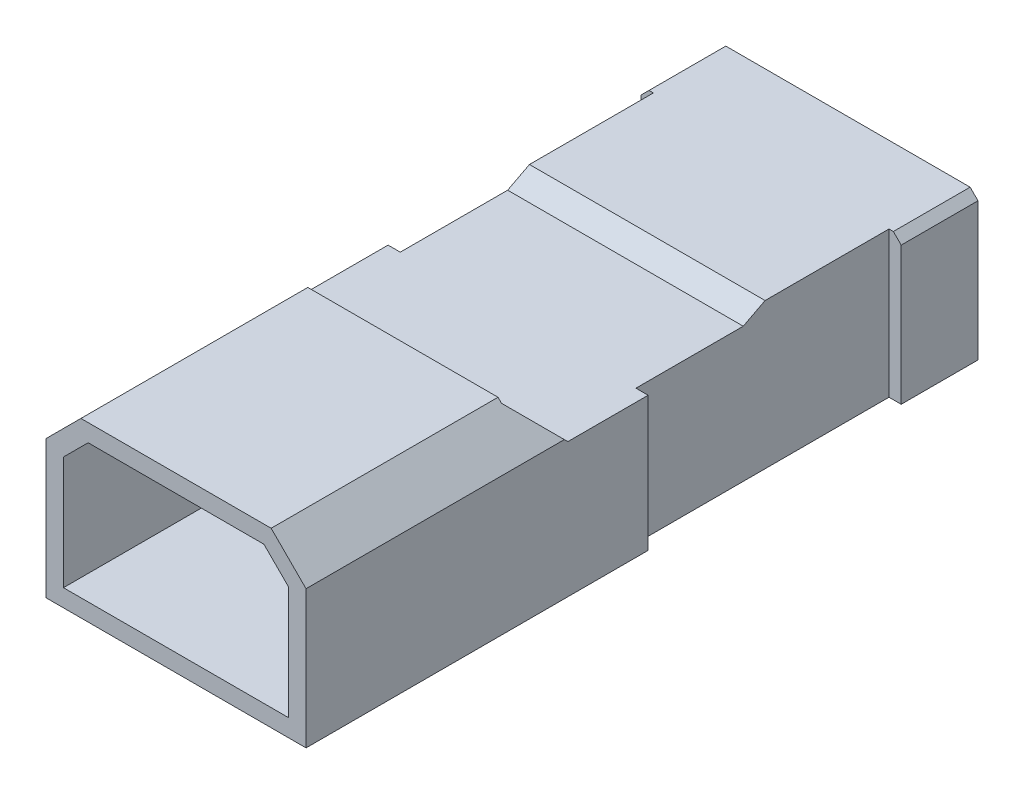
ISO-10303-21;
HEADER;
FILE_DESCRIPTION(('STEP AP214'),'2;1');
FILE_NAME('part.step','',(''),(''),'','','');
FILE_SCHEMA(('AUTOMOTIVE_DESIGN { 1 0 10303 214 1 1 1 1 }'));
ENDSEC;
DATA;
#1=APPLICATION_CONTEXT('core data for automotive mechanical design processes');
#2=APPLICATION_PROTOCOL_DEFINITION('international standard','automotive_design',2000,#1);
#3=PRODUCT_CONTEXT('',#1,'mechanical');
#4=PRODUCT('Part','Part','',(#3));
#5=PRODUCT_RELATED_PRODUCT_CATEGORY('part','',(#4));
#6=PRODUCT_DEFINITION_FORMATION('','',#4);
#7=PRODUCT_DEFINITION_CONTEXT('part definition',#1,'design');
#8=PRODUCT_DEFINITION('design','',#6,#7);
#9=PRODUCT_DEFINITION_SHAPE('','',#8);
#10=(LENGTH_UNIT() NAMED_UNIT(*) SI_UNIT(.MILLI.,.METRE.));
#11=(NAMED_UNIT(*) PLANE_ANGLE_UNIT() SI_UNIT($,.RADIAN.));
#12=(NAMED_UNIT(*) SI_UNIT($,.STERADIAN.) SOLID_ANGLE_UNIT());
#13=UNCERTAINTY_MEASURE_WITH_UNIT(LENGTH_MEASURE(1.E-05),#10,'distance_accuracy_value','');
#14=(GEOMETRIC_REPRESENTATION_CONTEXT(3) GLOBAL_UNCERTAINTY_ASSIGNED_CONTEXT((#13)) GLOBAL_UNIT_ASSIGNED_CONTEXT((#10,
#11,#12)) REPRESENTATION_CONTEXT('',''));
#15=CARTESIAN_POINT('',(0.,0.,0.));
#16=DIRECTION('',(0.,0.,1.));
#17=DIRECTION('',(1.,0.,0.));
#18=AXIS2_PLACEMENT_3D('',#15,#16,#17);
#19=CARTESIAN_POINT('',(-17.7816005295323,1.9558,12.954));
#20=DIRECTION('',(0.,0.,1.));
#21=DIRECTION('',(1.,0.,0.));
#22=AXIS2_PLACEMENT_3D('',#19,#20,#21);
#23=PLANE('',#22);
#24=DIRECTION('',(-0.707106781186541,-0.707106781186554,0.));
#25=VECTOR('',#24,1.);
#26=CARTESIAN_POINT('',(-2.76859999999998,2.5146,12.954));
#27=LINE('',#26,#25);
#28=CARTESIAN_POINT('',(-2.76859999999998,2.51459999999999,12.954));
#29=VERTEX_POINT('',#28);
#30=CARTESIAN_POINT('',(-2.87019999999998,2.413,12.954));
#31=VERTEX_POINT('',#30);
#32=EDGE_CURVE('E20',#29,#31,#27,.T.);
#33=ORIENTED_EDGE('',*,*,#32,.F.);
#34=DIRECTION('',(-1.,0.,0.));
#35=VECTOR('',#34,1.);
#36=CARTESIAN_POINT('',(0.,2.51459999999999,12.954));
#37=LINE('',#36,#35);
#38=CARTESIAN_POINT('',(2.7686,2.5146,12.954));
#39=VERTEX_POINT('',#38);
#40=EDGE_CURVE('E385',#39,#29,#37,.T.);
#41=ORIENTED_EDGE('',*,*,#40,.F.);
#42=DIRECTION('',(-0.707106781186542,0.707106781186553,0.));
#43=VECTOR('',#42,1.);
#44=CARTESIAN_POINT('',(3.2766,2.00659999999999,12.954));
#45=LINE('',#44,#43);
#46=CARTESIAN_POINT('',(2.8702,2.413,12.954));
#47=VERTEX_POINT('',#46);
#48=EDGE_CURVE('E345',#47,#39,#45,.T.);
#49=ORIENTED_EDGE('',*,*,#48,.F.);
#50=DIRECTION('',(1.,0.,0.));
#51=VECTOR('',#50,1.);
#52=CARTESIAN_POINT('',(-17.7816005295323,2.413,12.954));
#53=LINE('',#52,#51);
#54=EDGE_CURVE('E303',#31,#47,#53,.T.);
#55=ORIENTED_EDGE('',*,*,#54,.F.);
#56=EDGE_LOOP('',(#33,#41,#49,#55));
#57=FACE_BOUND('',#56,.T.);
#58=ADVANCED_FACE('F17',(#57),#23,.F.);
#59=CARTESIAN_POINT('',(-3.60679999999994,-19.0516005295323,10.1092));
#60=DIRECTION('',(0.,0.,1.));
#61=DIRECTION('',(1.,0.,0.));
#62=AXIS2_PLACEMENT_3D('',#59,#60,#61);
#63=PLANE('',#62);
#64=DIRECTION('',(1.,0.,0.));
#65=VECTOR('',#64,1.);
#66=CARTESIAN_POINT('',(-3.60679999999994,-2.0066,10.1092));
#67=LINE('',#66,#65);
#68=CARTESIAN_POINT('',(-3.2766,-2.0066,10.1092));
#69=VERTEX_POINT('',#68);
#70=CARTESIAN_POINT('',(-2.92099999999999,-2.0066,10.1092));
#71=VERTEX_POINT('',#70);
#72=EDGE_CURVE('E326',#69,#71,#67,.T.);
#73=ORIENTED_EDGE('',*,*,#72,.T.);
#74=DIRECTION('',(0.,1.,0.));
#75=VECTOR('',#74,1.);
#76=CARTESIAN_POINT('',(-2.92099999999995,-19.0516005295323,10.1092));
#77=LINE('',#76,#75);
#78=CARTESIAN_POINT('',(-2.921,0.888999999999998,10.1092));
#79=VERTEX_POINT('',#78);
#80=EDGE_CURVE('E399',#79,#71,#77,.F.);
#81=ORIENTED_EDGE('',*,*,#80,.F.);
#82=DIRECTION('',(1.,0.,0.));
#83=VECTOR('',#82,1.);
#84=CARTESIAN_POINT('',(-17.7816005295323,0.888999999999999,10.1092));
#85=LINE('',#84,#83);
#86=CARTESIAN_POINT('',(-3.2766,0.888999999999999,10.1092));
#87=VERTEX_POINT('',#86);
#88=EDGE_CURVE('E310',#87,#79,#85,.T.);
#89=ORIENTED_EDGE('',*,*,#88,.F.);
#90=DIRECTION('',(0.,1.,0.));
#91=VECTOR('',#90,1.);
#92=CARTESIAN_POINT('',(-3.2766,-0.508,10.1092));
#93=LINE('',#92,#91);
#94=EDGE_CURVE('E375',#87,#69,#93,.F.);
#95=ORIENTED_EDGE('',*,*,#94,.T.);
#96=EDGE_LOOP('',(#73,#81,#89,#95));
#97=FACE_BOUND('',#96,.T.);
#98=ADVANCED_FACE('F1001',(#97),#63,.T.);
#99=CARTESIAN_POINT('',(-17.7816005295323,1.54578975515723,12.8052102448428));
#100=DIRECTION('',(0.,0.707106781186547,-0.707106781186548));
#101=DIRECTION('',(0.,0.707106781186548,0.707106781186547));
#102=AXIS2_PLACEMENT_3D('',#99,#100,#101);
#103=PLANE('',#102);
#104=DIRECTION('',(-1.,0.,0.));
#105=VECTOR('',#104,1.);
#106=CARTESIAN_POINT('',(0.,2.00659999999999,13.2660204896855));
#107=LINE('',#106,#105);
#108=CARTESIAN_POINT('',(2.55817951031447,2.00659999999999,13.2660204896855));
#109=VERTEX_POINT('',#108);
#110=CARTESIAN_POINT('',(-2.55817951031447,2.00659999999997,13.2660204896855));
#111=VERTEX_POINT('',#110);
#112=EDGE_CURVE('E367',#109,#111,#107,.T.);
#113=ORIENTED_EDGE('',*,*,#112,.T.);
#114=DIRECTION('',(-0.577350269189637,-0.577350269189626,-0.577350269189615));
#115=VECTOR('',#114,1.);
#116=CARTESIAN_POINT('',(-2.55817951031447,2.00659999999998,13.2660204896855));
#117=LINE('',#116,#115);
#118=CARTESIAN_POINT('',(-3.2766,1.28817951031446,12.5476));
#119=VERTEX_POINT('',#118);
#120=EDGE_CURVE('E321',#111,#119,#117,.T.);
#121=ORIENTED_EDGE('',*,*,#120,.T.);
#122=DIRECTION('',(0.,-0.707106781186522,-0.707106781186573));
#123=VECTOR('',#122,1.);
#124=CARTESIAN_POINT('',(-3.2766,1.28817951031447,12.5476));
#125=LINE('',#124,#123);
#126=CARTESIAN_POINT('',(-3.2766,0.888999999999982,12.1484204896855));
#127=VERTEX_POINT('',#126);
#128=EDGE_CURVE('E380',#119,#127,#125,.T.);
#129=ORIENTED_EDGE('',*,*,#128,.T.);
#130=DIRECTION('',(1.,0.,0.));
#131=VECTOR('',#130,1.);
#132=CARTESIAN_POINT('',(-17.7816005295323,0.888999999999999,12.1484204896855));
#133=LINE('',#132,#131);
#134=CARTESIAN_POINT('',(3.2766,0.888999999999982,12.1484204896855));
#135=VERTEX_POINT('',#134);
#136=EDGE_CURVE('E312',#135,#127,#133,.F.);
#137=ORIENTED_EDGE('',*,*,#136,.F.);
#138=DIRECTION('',(0.,0.707106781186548,0.707106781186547));
#139=VECTOR('',#138,1.);
#140=CARTESIAN_POINT('',(3.2766,1.54578975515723,12.8052102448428));
#141=LINE('',#140,#139);
#142=CARTESIAN_POINT('',(3.2766,1.28817951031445,12.5476));
#143=VERTEX_POINT('',#142);
#144=EDGE_CURVE('E325',#143,#135,#141,.F.);
#145=ORIENTED_EDGE('',*,*,#144,.F.);
#146=DIRECTION('',(-0.577350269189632,0.577350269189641,0.577350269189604));
#147=VECTOR('',#146,1.);
#148=CARTESIAN_POINT('',(3.2766,1.28817951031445,12.5476));
#149=LINE('',#148,#147);
#150=EDGE_CURVE('E317',#143,#109,#149,.T.);
#151=ORIENTED_EDGE('',*,*,#150,.T.);
#152=EDGE_LOOP('',(#113,#121,#129,#137,#145,#151));
#153=FACE_BOUND('',#152,.T.);
#154=ADVANCED_FACE('F628',(#153),#103,.F.);
#155=CARTESIAN_POINT('',(-2.91738975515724,1.64738975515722,0.));
#156=DIRECTION('',(-0.707106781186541,0.707106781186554,0.));
#157=DIRECTION('',(-0.707106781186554,-0.707106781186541,0.));
#158=AXIS2_PLACEMENT_3D('',#155,#156,#157);
#159=PLANE('',#158);
#160=DIRECTION('',(0.,0.,1.));
#161=VECTOR('',#160,1.);
#162=CARTESIAN_POINT('',(-2.55817951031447,2.00659999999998,0.));
#163=LINE('',#162,#161);
#164=CARTESIAN_POINT('',(-2.55817951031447,2.00659999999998,19.558));
#165=VERTEX_POINT('',#164);
#166=EDGE_CURVE('E364',#111,#165,#163,.T.);
#167=ORIENTED_EDGE('',*,*,#166,.T.);
#168=DIRECTION('',(-0.707106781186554,-0.707106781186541,0.));
#169=VECTOR('',#168,1.);
#170=CARTESIAN_POINT('',(-2.91738975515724,1.64738975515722,19.558));
#171=LINE('',#170,#169);
#172=CARTESIAN_POINT('',(-3.2766,1.28817951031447,19.558));
#173=VERTEX_POINT('',#172);
#174=EDGE_CURVE('E323',#173,#165,#171,.F.);
#175=ORIENTED_EDGE('',*,*,#174,.F.);
#176=DIRECTION('',(0.,0.,1.));
#177=VECTOR('',#176,1.);
#178=CARTESIAN_POINT('',(-3.2766,1.28817951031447,0.));
#179=LINE('',#178,#177);
#180=EDGE_CURVE('E372',#173,#119,#179,.F.);
#181=ORIENTED_EDGE('',*,*,#180,.T.);
#182=ORIENTED_EDGE('',*,*,#120,.F.);
#183=EDGE_LOOP('',(#167,#175,#181,#182));
#184=FACE_BOUND('',#183,.T.);
#185=ADVANCED_FACE('F633',(#184),#159,.F.);
#186=CARTESIAN_POINT('',(2.91738975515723,1.64738975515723,0.));
#187=DIRECTION('',(0.707106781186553,0.707106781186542,0.));
#188=DIRECTION('',(-0.707106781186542,0.707106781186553,0.));
#189=AXIS2_PLACEMENT_3D('',#186,#187,#188);
#190=PLANE('',#189);
#191=ORIENTED_EDGE('',*,*,#150,.F.);
#192=DIRECTION('',(0.,0.,-1.));
#193=VECTOR('',#192,1.);
#194=CARTESIAN_POINT('',(3.2766,1.28817951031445,0.));
#195=LINE('',#194,#193);
#196=CARTESIAN_POINT('',(3.2766,1.28817951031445,19.558));
#197=VERTEX_POINT('',#196);
#198=EDGE_CURVE('E361',#143,#197,#195,.F.);
#199=ORIENTED_EDGE('',*,*,#198,.T.);
#200=DIRECTION('',(-0.707106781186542,0.707106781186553,0.));
#201=VECTOR('',#200,1.);
#202=CARTESIAN_POINT('',(2.91738975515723,1.64738975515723,19.558));
#203=LINE('',#202,#201);
#204=CARTESIAN_POINT('',(2.55817951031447,2.00659999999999,19.558));
#205=VERTEX_POINT('',#204);
#206=EDGE_CURVE('E319',#205,#197,#203,.F.);
#207=ORIENTED_EDGE('',*,*,#206,.F.);
#208=DIRECTION('',(0.,0.,1.));
#209=VECTOR('',#208,1.);
#210=CARTESIAN_POINT('',(2.55817951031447,2.0066,0.));
#211=LINE('',#210,#209);
#212=EDGE_CURVE('E369',#205,#109,#211,.F.);
#213=ORIENTED_EDGE('',*,*,#212,.T.);
#214=EDGE_LOOP('',(#191,#199,#207,#213));
#215=FACE_BOUND('',#214,.T.);
#216=ADVANCED_FACE('F640',(#215),#190,.F.);
#217=CARTESIAN_POINT('',(3.60680000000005,-19.0516005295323,10.1092));
#218=DIRECTION('',(0.,0.,1.));
#219=DIRECTION('',(1.,0.,0.));
#220=AXIS2_PLACEMENT_3D('',#217,#218,#219);
#221=PLANE('',#220);
#222=DIRECTION('',(1.,0.,0.));
#223=VECTOR('',#222,1.);
#224=CARTESIAN_POINT('',(3.60680000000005,-2.0066,10.1092));
#225=LINE('',#224,#223);
#226=CARTESIAN_POINT('',(2.921,-2.0066,10.1092));
#227=VERTEX_POINT('',#226);
#228=CARTESIAN_POINT('',(3.2766,-2.0066,10.1092));
#229=VERTEX_POINT('',#228);
#230=EDGE_CURVE('E315',#227,#229,#225,.T.);
#231=ORIENTED_EDGE('',*,*,#230,.T.);
#232=DIRECTION('',(0.,1.,0.));
#233=VECTOR('',#232,1.);
#234=CARTESIAN_POINT('',(3.2766,-0.508000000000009,10.1092));
#235=LINE('',#234,#233);
#236=CARTESIAN_POINT('',(3.2766,0.888999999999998,10.1092));
#237=VERTEX_POINT('',#236);
#238=EDGE_CURVE('E356',#229,#237,#235,.T.);
#239=ORIENTED_EDGE('',*,*,#238,.T.);
#240=DIRECTION('',(1.,0.,0.));
#241=VECTOR('',#240,1.);
#242=CARTESIAN_POINT('',(-17.7816005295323,0.888999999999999,10.1092));
#243=LINE('',#242,#241);
#244=CARTESIAN_POINT('',(2.921,0.888999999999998,10.1092));
#245=VERTEX_POINT('',#244);
#246=EDGE_CURVE('E265',#245,#237,#243,.T.);
#247=ORIENTED_EDGE('',*,*,#246,.F.);
#248=DIRECTION('',(0.,-1.,0.));
#249=VECTOR('',#248,1.);
#250=CARTESIAN_POINT('',(2.92100000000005,-19.0516005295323,10.1092));
#251=LINE('',#250,#249);
#252=EDGE_CURVE('E295',#227,#245,#251,.F.);
#253=ORIENTED_EDGE('',*,*,#252,.F.);
#254=EDGE_LOOP('',(#231,#239,#247,#253));
#255=FACE_BOUND('',#254,.T.);
#256=ADVANCED_FACE('F624',(#255),#221,.T.);
#257=CARTESIAN_POINT('',(-17.7816005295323,0.888999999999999,9.7155));
#258=DIRECTION('',(0.,-1.,0.));
#259=DIRECTION('',(0.,0.,-1.));
#260=AXIS2_PLACEMENT_3D('',#257,#258,#259);
#261=PLANE('',#260);
#262=ORIENTED_EDGE('',*,*,#246,.T.);
#263=DIRECTION('',(0.,0.,-1.));
#264=VECTOR('',#263,1.);
#265=CARTESIAN_POINT('',(3.2766,0.888999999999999,0.));
#266=LINE('',#265,#264);
#267=EDGE_CURVE('E351',#237,#135,#266,.F.);
#268=ORIENTED_EDGE('',*,*,#267,.T.);
#269=ORIENTED_EDGE('',*,*,#136,.T.);
#270=DIRECTION('',(0.,0.,1.));
#271=VECTOR('',#270,1.);
#272=CARTESIAN_POINT('',(-3.2766,0.888999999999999,0.));
#273=LINE('',#272,#271);
#274=EDGE_CURVE('E377',#127,#87,#273,.F.);
#275=ORIENTED_EDGE('',*,*,#274,.T.);
#276=ORIENTED_EDGE('',*,*,#88,.T.);
#277=DIRECTION('',(0.,0.,1.));
#278=VECTOR('',#277,1.);
#279=CARTESIAN_POINT('',(-2.92100000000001,0.888999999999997,5.9182));
#280=LINE('',#279,#278);
#281=CARTESIAN_POINT('',(-2.921,0.888999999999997,6.352813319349));
#282=VERTEX_POINT('',#281);
#283=EDGE_CURVE('E277',#282,#79,#280,.T.);
#284=ORIENTED_EDGE('',*,*,#283,.F.);
#285=DIRECTION('',(1.,0.,0.));
#286=VECTOR('',#285,1.);
#287=CARTESIAN_POINT('',(-17.7816005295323,0.888999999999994,6.352813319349));
#288=LINE('',#287,#286);
#289=CARTESIAN_POINT('',(2.921,0.888999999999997,6.352813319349));
#290=VERTEX_POINT('',#289);
#291=EDGE_CURVE('E270',#290,#282,#288,.F.);
#292=ORIENTED_EDGE('',*,*,#291,.F.);
#293=DIRECTION('',(0.,0.,1.));
#294=VECTOR('',#293,1.);
#295=CARTESIAN_POINT('',(2.92099999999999,0.888999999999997,5.9182));
#296=LINE('',#295,#294);
#297=EDGE_CURVE('E274',#245,#290,#296,.F.);
#298=ORIENTED_EDGE('',*,*,#297,.F.);
#299=EDGE_LOOP('',(#262,#268,#269,#275,#276,#284,#292,#298));
#300=FACE_BOUND('',#299,.T.);
#301=ADVANCED_FACE('F272',(#300),#261,.T.);
#302=CARTESIAN_POINT('',(-17.7816005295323,1.905,12.446));
#303=DIRECTION('',(0.,0.707106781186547,-0.707106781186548));
#304=DIRECTION('',(0.,0.707106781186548,0.707106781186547));
#305=AXIS2_PLACEMENT_3D('',#302,#303,#304);
#306=PLANE('',#305);
#307=ORIENTED_EDGE('',*,*,#54,.T.);
#308=DIRECTION('',(-0.577350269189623,0.577350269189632,0.577350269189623));
#309=VECTOR('',#308,1.);
#310=CARTESIAN_POINT('',(3.7846,1.49859999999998,12.0396));
#311=LINE('',#310,#309);
#312=CARTESIAN_POINT('',(3.7846,1.49859999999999,12.0396));
#313=VERTEX_POINT('',#312);
#314=EDGE_CURVE('E392',#313,#47,#311,.T.);
#315=ORIENTED_EDGE('',*,*,#314,.F.);
#316=DIRECTION('',(0.,0.707106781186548,0.707106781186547));
#317=VECTOR('',#316,1.);
#318=CARTESIAN_POINT('',(3.7846,1.905,12.446));
#319=LINE('',#318,#317);
#320=CARTESIAN_POINT('',(3.7846,1.397,11.938));
#321=VERTEX_POINT('',#320);
#322=EDGE_CURVE('E307',#313,#321,#319,.F.);
#323=ORIENTED_EDGE('',*,*,#322,.T.);
#324=DIRECTION('',(1.,0.,0.));
#325=VECTOR('',#324,1.);
#326=CARTESIAN_POINT('',(-17.7816005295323,1.397,11.938));
#327=LINE('',#326,#325);
#328=CARTESIAN_POINT('',(-3.7846,1.397,11.938));
#329=VERTEX_POINT('',#328);
#330=EDGE_CURVE('E449',#321,#329,#327,.F.);
#331=ORIENTED_EDGE('',*,*,#330,.T.);
#332=DIRECTION('',(0.,0.707106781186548,0.707106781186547));
#333=VECTOR('',#332,1.);
#334=CARTESIAN_POINT('',(-3.7846,1.905,12.446));
#335=LINE('',#334,#333);
#336=CARTESIAN_POINT('',(-3.7846,1.4986,12.0396));
#337=VERTEX_POINT('',#336);
#338=EDGE_CURVE('E305',#329,#337,#335,.T.);
#339=ORIENTED_EDGE('',*,*,#338,.T.);
#340=DIRECTION('',(-0.577350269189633,-0.577350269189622,-0.577350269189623));
#341=VECTOR('',#340,1.);
#342=CARTESIAN_POINT('',(-2.87019999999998,2.413,12.954));
#343=LINE('',#342,#341);
#344=EDGE_CURVE('E338',#31,#337,#343,.T.);
#345=ORIENTED_EDGE('',*,*,#344,.F.);
#346=EDGE_LOOP('',(#307,#315,#323,#331,#339,#345));
#347=FACE_BOUND('',#346,.T.);
#348=ADVANCED_FACE('F349',(#347),#306,.T.);
#349=CARTESIAN_POINT('',(-17.7816005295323,1.5621,6.1595));
#350=DIRECTION('',(0.,-0.887216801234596,-0.461352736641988));
#351=DIRECTION('',(0.,0.461352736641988,-0.887216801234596));
#352=AXIS2_PLACEMENT_3D('',#349,#350,#351);
#353=PLANE('',#352);
#354=DIRECTION('',(1.,0.,0.));
#355=VECTOR('',#354,1.);
#356=CARTESIAN_POINT('',(-17.7816005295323,1.7272,5.842));
#357=LINE('',#356,#355);
#358=CARTESIAN_POINT('',(3.429,1.7272,5.842));
#359=VERTEX_POINT('',#358);
#360=CARTESIAN_POINT('',(-3.429,1.7272,5.842));
#361=VERTEX_POINT('',#360);
#362=EDGE_CURVE('E439',#359,#361,#357,.F.);
#363=ORIENTED_EDGE('',*,*,#362,.T.);
#364=DIRECTION('',(0.,0.461352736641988,-0.887216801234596));
#365=VECTOR('',#364,1.);
#366=CARTESIAN_POINT('',(-3.42899999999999,1.5621,6.1595));
#367=LINE('',#366,#365);
#368=CARTESIAN_POINT('',(-3.429,1.397,6.477));
#369=VERTEX_POINT('',#368);
#370=EDGE_CURVE('E301',#369,#361,#367,.T.);
#371=ORIENTED_EDGE('',*,*,#370,.F.);
#372=DIRECTION('',(1.,0.,0.));
#373=VECTOR('',#372,1.);
#374=CARTESIAN_POINT('',(-17.7816005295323,1.397,6.477));
#375=LINE('',#374,#373);
#376=CARTESIAN_POINT('',(3.429,1.397,6.477));
#377=VERTEX_POINT('',#376);
#378=EDGE_CURVE('E453',#369,#377,#375,.T.);
#379=ORIENTED_EDGE('',*,*,#378,.T.);
#380=DIRECTION('',(0.,0.461352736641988,-0.887216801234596));
#381=VECTOR('',#380,1.);
#382=CARTESIAN_POINT('',(3.42900000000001,1.5621,6.1595));
#383=LINE('',#382,#381);
#384=EDGE_CURVE('E281',#359,#377,#383,.F.);
#385=ORIENTED_EDGE('',*,*,#384,.F.);
#386=EDGE_LOOP('',(#363,#371,#379,#385));
#387=FACE_BOUND('',#386,.T.);
#388=ADVANCED_FACE('F758',(#387),#353,.F.);
#389=CARTESIAN_POINT('',(-17.7816005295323,1.11139386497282,5.92513280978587));
#390=DIRECTION('',(0.,-0.887216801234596,-0.461352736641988));
#391=DIRECTION('',(0.,0.461352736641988,-0.887216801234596));
#392=AXIS2_PLACEMENT_3D('',#389,#390,#391);
#393=PLANE('',#392);
#394=DIRECTION('',(0.,-0.461352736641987,0.887216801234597));
#395=VECTOR('',#394,1.);
#396=CARTESIAN_POINT('',(-2.92100000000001,1.2192,5.71781331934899));
#397=LINE('',#396,#395);
#398=CARTESIAN_POINT('',(-2.921,1.2192,5.71781331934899));
#399=VERTEX_POINT('',#398);
#400=EDGE_CURVE('E397',#399,#282,#397,.T.);
#401=ORIENTED_EDGE('',*,*,#400,.F.);
#402=DIRECTION('',(1.,0.,0.));
#403=VECTOR('',#402,1.);
#404=CARTESIAN_POINT('',(-17.7816005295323,1.2192,5.71781331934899));
#405=LINE('',#404,#403);
#406=CARTESIAN_POINT('',(2.921,1.2192,5.71781331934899));
#407=VERTEX_POINT('',#406);
#408=EDGE_CURVE('E287',#407,#399,#405,.F.);
#409=ORIENTED_EDGE('',*,*,#408,.F.);
#410=DIRECTION('',(0.,0.461352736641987,-0.887216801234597));
#411=VECTOR('',#410,1.);
#412=CARTESIAN_POINT('',(2.92099999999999,0.888999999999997,6.352813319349));
#413=LINE('',#412,#411);
#414=EDGE_CURVE('E284',#290,#407,#413,.T.);
#415=ORIENTED_EDGE('',*,*,#414,.F.);
#416=ORIENTED_EDGE('',*,*,#291,.T.);
#417=EDGE_LOOP('',(#401,#409,#415,#416));
#418=FACE_BOUND('',#417,.T.);
#419=ADVANCED_FACE('F285',(#418),#393,.T.);
#420=CARTESIAN_POINT('',(3.60680000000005,-19.0516005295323,1.7272));
#421=DIRECTION('',(0.,0.,-1.));
#422=DIRECTION('',(-1.,0.,0.));
#423=AXIS2_PLACEMENT_3D('',#420,#421,#422);
#424=PLANE('',#423);
#425=DIRECTION('',(0.,-1.,0.));
#426=VECTOR('',#425,1.);
#427=CARTESIAN_POINT('',(2.92100000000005,-19.0516005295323,1.7272));
#428=LINE('',#427,#426);
#429=CARTESIAN_POINT('',(2.921,1.2192,1.7272));
#430=VERTEX_POINT('',#429);
#431=CARTESIAN_POINT('',(2.92100000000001,-2.0066,1.7272));
#432=VERTEX_POINT('',#431);
#433=EDGE_CURVE('E291',#430,#432,#428,.T.);
#434=ORIENTED_EDGE('',*,*,#433,.F.);
#435=DIRECTION('',(1.,0.,0.));
#436=VECTOR('',#435,1.);
#437=CARTESIAN_POINT('',(-17.7816005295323,1.2192,1.7272));
#438=LINE('',#437,#436);
#439=CARTESIAN_POINT('',(3.2766,1.2192,1.7272));
#440=VERTEX_POINT('',#439);
#441=EDGE_CURVE('E432',#440,#430,#438,.F.);
#442=ORIENTED_EDGE('',*,*,#441,.F.);
#443=DIRECTION('',(0.,1.,0.));
#444=VECTOR('',#443,1.);
#445=CARTESIAN_POINT('',(3.2766,-0.508000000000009,1.7272));
#446=LINE('',#445,#444);
#447=CARTESIAN_POINT('',(3.2766,-2.0066,1.7272));
#448=VERTEX_POINT('',#447);
#449=EDGE_CURVE('E419',#440,#448,#446,.F.);
#450=ORIENTED_EDGE('',*,*,#449,.T.);
#451=DIRECTION('',(-1.,0.,0.));
#452=VECTOR('',#451,1.);
#453=CARTESIAN_POINT('',(3.60680000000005,-2.0066,1.7272));
#454=LINE('',#453,#452);
#455=EDGE_CURVE('E280',#448,#432,#454,.T.);
#456=ORIENTED_EDGE('',*,*,#455,.T.);
#457=EDGE_LOOP('',(#434,#442,#450,#456));
#458=FACE_BOUND('',#457,.T.);
#459=ADVANCED_FACE('F753',(#458),#424,.T.);
#460=CARTESIAN_POINT('',(2.92100000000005,-19.0516005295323,5.9182));
#461=DIRECTION('',(-1.,0.,0.));
#462=DIRECTION('',(0.,-1.,0.));
#463=AXIS2_PLACEMENT_3D('',#460,#461,#462);
#464=PLANE('',#463);
#465=DIRECTION('',(0.,0.,-1.));
#466=VECTOR('',#465,1.);
#467=CARTESIAN_POINT('',(2.92100000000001,-2.0066,0.));
#468=LINE('',#467,#466);
#469=EDGE_CURVE('E404',#432,#227,#468,.F.);
#470=ORIENTED_EDGE('',*,*,#469,.T.);
#471=ORIENTED_EDGE('',*,*,#252,.T.);
#472=ORIENTED_EDGE('',*,*,#297,.T.);
#473=ORIENTED_EDGE('',*,*,#414,.T.);
#474=DIRECTION('',(0.,0.,-1.));
#475=VECTOR('',#474,1.);
#476=CARTESIAN_POINT('',(2.921,1.2192,2.92099999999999));
#477=LINE('',#476,#475);
#478=EDGE_CURVE('E405',#430,#407,#477,.F.);
#479=ORIENTED_EDGE('',*,*,#478,.F.);
#480=ORIENTED_EDGE('',*,*,#433,.T.);
#481=EDGE_LOOP('',(#470,#471,#472,#473,#479,#480));
#482=FACE_BOUND('',#481,.T.);
#483=ADVANCED_FACE('F294',(#482),#464,.T.);
#484=CARTESIAN_POINT('',(-2.92099999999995,-19.0516005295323,5.9182));
#485=DIRECTION('',(1.,0.,0.));
#486=DIRECTION('',(0.,1.,0.));
#487=AXIS2_PLACEMENT_3D('',#484,#485,#486);
#488=PLANE('',#487);
#489=DIRECTION('',(0.,0.,-1.));
#490=VECTOR('',#489,1.);
#491=CARTESIAN_POINT('',(-2.921,1.2192,2.92099999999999));
#492=LINE('',#491,#490);
#493=CARTESIAN_POINT('',(-2.921,1.2192,1.7272));
#494=VERTEX_POINT('',#493);
#495=EDGE_CURVE('E427',#399,#494,#492,.T.);
#496=ORIENTED_EDGE('',*,*,#495,.F.);
#497=ORIENTED_EDGE('',*,*,#400,.T.);
#498=ORIENTED_EDGE('',*,*,#283,.T.);
#499=ORIENTED_EDGE('',*,*,#80,.T.);
#500=DIRECTION('',(0.,0.,-1.));
#501=VECTOR('',#500,1.);
#502=CARTESIAN_POINT('',(-2.92099999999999,-2.0066,0.));
#503=LINE('',#502,#501);
#504=CARTESIAN_POINT('',(-2.921,-2.0066,1.7272));
#505=VERTEX_POINT('',#504);
#506=EDGE_CURVE('E605',#71,#505,#503,.T.);
#507=ORIENTED_EDGE('',*,*,#506,.T.);
#508=DIRECTION('',(0.,1.,0.));
#509=VECTOR('',#508,1.);
#510=CARTESIAN_POINT('',(-2.921,-19.0516005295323,1.7272));
#511=LINE('',#510,#509);
#512=EDGE_CURVE('E394',#494,#505,#511,.F.);
#513=ORIENTED_EDGE('',*,*,#512,.F.);
#514=EDGE_LOOP('',(#496,#497,#498,#499,#507,#513));
#515=FACE_BOUND('',#514,.T.);
#516=ADVANCED_FACE('F746',(#515),#488,.T.);
#517=CARTESIAN_POINT('',(-3.60679999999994,-19.0516005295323,1.7272));
#518=DIRECTION('',(0.,0.,-1.));
#519=DIRECTION('',(-1.,0.,0.));
#520=AXIS2_PLACEMENT_3D('',#517,#518,#519);
#521=PLANE('',#520);
#522=DIRECTION('',(1.,0.,0.));
#523=VECTOR('',#522,1.);
#524=CARTESIAN_POINT('',(0.,-2.0066,1.7272));
#525=LINE('',#524,#523);
#526=CARTESIAN_POINT('',(-3.2766,-2.0066,1.7272));
#527=VERTEX_POINT('',#526);
#528=EDGE_CURVE('E603',#505,#527,#525,.F.);
#529=ORIENTED_EDGE('',*,*,#528,.T.);
#530=DIRECTION('',(0.,1.,0.));
#531=VECTOR('',#530,1.);
#532=CARTESIAN_POINT('',(-3.2766,-0.508,1.7272));
#533=LINE('',#532,#531);
#534=CARTESIAN_POINT('',(-3.2766,1.2192,1.7272));
#535=VERTEX_POINT('',#534);
#536=EDGE_CURVE('E595',#527,#535,#533,.T.);
#537=ORIENTED_EDGE('',*,*,#536,.T.);
#538=DIRECTION('',(1.,0.,0.));
#539=VECTOR('',#538,1.);
#540=CARTESIAN_POINT('',(-17.7816005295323,1.2192,1.7272));
#541=LINE('',#540,#539);
#542=EDGE_CURVE('E424',#494,#535,#541,.F.);
#543=ORIENTED_EDGE('',*,*,#542,.F.);
#544=ORIENTED_EDGE('',*,*,#512,.T.);
#545=EDGE_LOOP('',(#529,#537,#543,#544));
#546=FACE_BOUND('',#545,.T.);
#547=ADVANCED_FACE('F742',(#546),#521,.T.);
#548=CARTESIAN_POINT('',(3.2766,2.00659999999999,0.));
#549=DIRECTION('',(0.707106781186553,0.707106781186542,0.));
#550=DIRECTION('',(-0.707106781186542,0.707106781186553,0.));
#551=AXIS2_PLACEMENT_3D('',#548,#549,#550);
#552=PLANE('',#551);
#553=DIRECTION('',(0.,0.,1.));
#554=VECTOR('',#553,1.);
#555=CARTESIAN_POINT('',(2.7686,2.5146,0.));
#556=LINE('',#555,#554);
#557=CARTESIAN_POINT('',(2.7686,2.5146,19.558));
#558=VERTEX_POINT('',#557);
#559=EDGE_CURVE('E382',#558,#39,#556,.F.);
#560=ORIENTED_EDGE('',*,*,#559,.F.);
#561=DIRECTION('',(-0.707106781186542,0.707106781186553,0.));
#562=VECTOR('',#561,1.);
#563=CARTESIAN_POINT('',(3.2766,2.00659999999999,19.558));
#564=LINE('',#563,#562);
#565=CARTESIAN_POINT('',(3.7846,1.49859999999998,19.558));
#566=VERTEX_POINT('',#565);
#567=EDGE_CURVE('E389',#558,#566,#564,.F.);
#568=ORIENTED_EDGE('',*,*,#567,.T.);
#569=DIRECTION('',(0.,0.,-1.));
#570=VECTOR('',#569,1.);
#571=CARTESIAN_POINT('',(3.7846,1.49859999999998,0.));
#572=LINE('',#571,#570);
#573=EDGE_CURVE('E567',#313,#566,#572,.F.);
#574=ORIENTED_EDGE('',*,*,#573,.F.);
#575=ORIENTED_EDGE('',*,*,#314,.T.);
#576=ORIENTED_EDGE('',*,*,#48,.T.);
#577=EDGE_LOOP('',(#560,#568,#574,#575,#576));
#578=FACE_BOUND('',#577,.T.);
#579=ADVANCED_FACE('F738',(#578),#552,.T.);
#580=CARTESIAN_POINT('',(3.60680000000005,-19.0516005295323,9.6012));
#581=DIRECTION('',(0.,0.,1.));
#582=DIRECTION('',(1.,0.,0.));
#583=AXIS2_PLACEMENT_3D('',#580,#581,#582);
#584=PLANE('',#583);
#585=DIRECTION('',(0.,1.,0.));
#586=VECTOR('',#585,1.);
#587=CARTESIAN_POINT('',(3.7846,-0.508000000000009,9.6012));
#588=LINE('',#587,#586);
#589=CARTESIAN_POINT('',(3.7846,-2.5146,9.6012));
#590=VERTEX_POINT('',#589);
#591=CARTESIAN_POINT('',(3.78460000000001,1.397,9.6012));
#592=VERTEX_POINT('',#591);
#593=EDGE_CURVE('E564',#590,#592,#588,.T.);
#594=ORIENTED_EDGE('',*,*,#593,.F.);
#595=DIRECTION('',(1.,0.,0.));
#596=VECTOR('',#595,1.);
#597=CARTESIAN_POINT('',(3.60680000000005,-2.5146,9.6012));
#598=LINE('',#597,#596);
#599=CARTESIAN_POINT('',(3.429,-2.5146,9.6012));
#600=VERTEX_POINT('',#599);
#601=EDGE_CURVE('E387',#600,#590,#598,.T.);
#602=ORIENTED_EDGE('',*,*,#601,.F.);
#603=DIRECTION('',(0.,-1.,0.));
#604=VECTOR('',#603,1.);
#605=CARTESIAN_POINT('',(3.42900000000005,-19.0516005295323,9.6012));
#606=LINE('',#605,#604);
#607=CARTESIAN_POINT('',(3.429,1.397,9.6012));
#608=VERTEX_POINT('',#607);
#609=EDGE_CURVE('E576',#600,#608,#606,.F.);
#610=ORIENTED_EDGE('',*,*,#609,.T.);
#611=DIRECTION('',(1.,0.,0.));
#612=VECTOR('',#611,1.);
#613=CARTESIAN_POINT('',(-17.7816005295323,1.397,9.6012));
#614=LINE('',#613,#612);
#615=EDGE_CURVE('E451',#608,#592,#614,.T.);
#616=ORIENTED_EDGE('',*,*,#615,.T.);
#617=EDGE_LOOP('',(#594,#602,#610,#616));
#618=FACE_BOUND('',#617,.T.);
#619=ADVANCED_FACE('F734',(#618),#584,.F.);
#620=CARTESIAN_POINT('',(0.,2.51459999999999,0.));
#621=DIRECTION('',(0.,1.,0.));
#622=DIRECTION('',(-1.,0.,0.));
#623=AXIS2_PLACEMENT_3D('',#620,#621,#622);
#624=PLANE('',#623);
#625=DIRECTION('',(1.,0.,0.));
#626=VECTOR('',#625,1.);
#627=CARTESIAN_POINT('',(0.,2.5146,19.558));
#628=LINE('',#627,#626);
#629=CARTESIAN_POINT('',(-2.76859999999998,2.51459999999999,19.558));
#630=VERTEX_POINT('',#629);
#631=EDGE_CURVE('E558',#558,#630,#628,.F.);
#632=ORIENTED_EDGE('',*,*,#631,.F.);
#633=ORIENTED_EDGE('',*,*,#559,.T.);
#634=ORIENTED_EDGE('',*,*,#40,.T.);
#635=DIRECTION('',(0.,0.,1.));
#636=VECTOR('',#635,1.);
#637=CARTESIAN_POINT('',(-2.7686,2.51459999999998,0.));
#638=LINE('',#637,#636);
#639=EDGE_CURVE('E340',#630,#29,#638,.F.);
#640=ORIENTED_EDGE('',*,*,#639,.F.);
#641=EDGE_LOOP('',(#632,#633,#634,#640));
#642=FACE_BOUND('',#641,.T.);
#643=ADVANCED_FACE('F731',(#642),#624,.T.);
#644=CARTESIAN_POINT('',(-3.2766,-0.508,0.));
#645=DIRECTION('',(-1.,0.,0.));
#646=DIRECTION('',(0.,0.,1.));
#647=AXIS2_PLACEMENT_3D('',#644,#645,#646);
#648=PLANE('',#647);
#649=DIRECTION('',(0.,1.,0.));
#650=VECTOR('',#649,1.);
#651=CARTESIAN_POINT('',(-3.2766,-0.14249268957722,19.558));
#652=LINE('',#651,#650);
#653=CARTESIAN_POINT('',(-3.2766,-2.0066,19.558));
#654=VERTEX_POINT('',#653);
#655=EDGE_CURVE('E552',#654,#173,#652,.T.);
#656=ORIENTED_EDGE('',*,*,#655,.F.);
#657=DIRECTION('',(0.,0.,-1.));
#658=VECTOR('',#657,1.);
#659=CARTESIAN_POINT('',(-3.2766,-2.0066,0.));
#660=LINE('',#659,#658);
#661=EDGE_CURVE('E416',#654,#69,#660,.T.);
#662=ORIENTED_EDGE('',*,*,#661,.T.);
#663=ORIENTED_EDGE('',*,*,#94,.F.);
#664=ORIENTED_EDGE('',*,*,#274,.F.);
#665=ORIENTED_EDGE('',*,*,#128,.F.);
#666=ORIENTED_EDGE('',*,*,#180,.F.);
#667=EDGE_LOOP('',(#656,#662,#663,#664,#665,#666));
#668=FACE_BOUND('',#667,.T.);
#669=ADVANCED_FACE('F610',(#668),#648,.F.);
#670=CARTESIAN_POINT('',(0.,2.00659999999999,0.));
#671=DIRECTION('',(0.,1.,0.));
#672=DIRECTION('',(-1.,0.,0.));
#673=AXIS2_PLACEMENT_3D('',#670,#671,#672);
#674=PLANE('',#673);
#675=ORIENTED_EDGE('',*,*,#112,.F.);
#676=ORIENTED_EDGE('',*,*,#212,.F.);
#677=DIRECTION('',(1.,0.,0.));
#678=VECTOR('',#677,1.);
#679=CARTESIAN_POINT('',(0.,2.00659999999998,19.558));
#680=LINE('',#679,#678);
#681=EDGE_CURVE('E549',#165,#205,#680,.T.);
#682=ORIENTED_EDGE('',*,*,#681,.F.);
#683=ORIENTED_EDGE('',*,*,#166,.F.);
#684=EDGE_LOOP('',(#675,#676,#682,#683));
#685=FACE_BOUND('',#684,.T.);
#686=ADVANCED_FACE('F637',(#685),#674,.F.);
#687=CARTESIAN_POINT('',(3.2766,-0.508000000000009,0.));
#688=DIRECTION('',(1.,0.,0.));
#689=DIRECTION('',(0.,0.,-1.));
#690=AXIS2_PLACEMENT_3D('',#687,#688,#689);
#691=PLANE('',#690);
#692=ORIENTED_EDGE('',*,*,#238,.F.);
#693=DIRECTION('',(0.,0.,-1.));
#694=VECTOR('',#693,1.);
#695=CARTESIAN_POINT('',(3.2766,-2.0066,0.));
#696=LINE('',#695,#694);
#697=CARTESIAN_POINT('',(3.2766,-2.0066,19.558));
#698=VERTEX_POINT('',#697);
#699=EDGE_CURVE('E413',#229,#698,#696,.F.);
#700=ORIENTED_EDGE('',*,*,#699,.T.);
#701=DIRECTION('',(0.,1.,0.));
#702=VECTOR('',#701,1.);
#703=CARTESIAN_POINT('',(3.2766,-0.14249268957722,19.558));
#704=LINE('',#703,#702);
#705=EDGE_CURVE('E546',#197,#698,#704,.F.);
#706=ORIENTED_EDGE('',*,*,#705,.F.);
#707=ORIENTED_EDGE('',*,*,#198,.F.);
#708=ORIENTED_EDGE('',*,*,#144,.T.);
#709=ORIENTED_EDGE('',*,*,#267,.F.);
#710=EDGE_LOOP('',(#692,#700,#706,#707,#708,#709));
#711=FACE_BOUND('',#710,.T.);
#712=ADVANCED_FACE('F622',(#711),#691,.F.);
#713=CARTESIAN_POINT('',(-3.2766,2.00659999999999,0.));
#714=DIRECTION('',(-0.707106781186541,0.707106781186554,0.));
#715=DIRECTION('',(-0.707106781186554,-0.707106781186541,0.));
#716=AXIS2_PLACEMENT_3D('',#713,#714,#715);
#717=PLANE('',#716);
#718=DIRECTION('',(-0.707106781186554,-0.707106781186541,0.));
#719=VECTOR('',#718,1.);
#720=CARTESIAN_POINT('',(-2.7686,2.51459999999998,19.558));
#721=LINE('',#720,#719);
#722=CARTESIAN_POINT('',(-3.7846,1.4986,19.558));
#723=VERTEX_POINT('',#722);
#724=EDGE_CURVE('E555',#630,#723,#721,.T.);
#725=ORIENTED_EDGE('',*,*,#724,.F.);
#726=ORIENTED_EDGE('',*,*,#639,.T.);
#727=ORIENTED_EDGE('',*,*,#32,.T.);
#728=ORIENTED_EDGE('',*,*,#344,.T.);
#729=DIRECTION('',(0.,0.,1.));
#730=VECTOR('',#729,1.);
#731=CARTESIAN_POINT('',(-3.7846,1.4986,0.));
#732=LINE('',#731,#730);
#733=EDGE_CURVE('E541',#723,#337,#732,.F.);
#734=ORIENTED_EDGE('',*,*,#733,.F.);
#735=EDGE_LOOP('',(#725,#726,#727,#728,#734));
#736=FACE_BOUND('',#735,.T.);
#737=ADVANCED_FACE('F336',(#736),#717,.T.);
#738=CARTESIAN_POINT('',(-3.60679999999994,-19.0516005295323,9.6012));
#739=DIRECTION('',(0.,0.,1.));
#740=DIRECTION('',(1.,0.,0.));
#741=AXIS2_PLACEMENT_3D('',#738,#739,#740);
#742=PLANE('',#741);
#743=DIRECTION('',(0.,1.,0.));
#744=VECTOR('',#743,1.);
#745=CARTESIAN_POINT('',(-3.42899999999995,-19.0516005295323,9.6012));
#746=LINE('',#745,#744);
#747=CARTESIAN_POINT('',(-3.429,1.397,9.6012));
#748=VERTEX_POINT('',#747);
#749=CARTESIAN_POINT('',(-3.42899999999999,-2.5146,9.6012));
#750=VERTEX_POINT('',#749);
#751=EDGE_CURVE('E472',#748,#750,#746,.F.);
#752=ORIENTED_EDGE('',*,*,#751,.T.);
#753=DIRECTION('',(1.,0.,0.));
#754=VECTOR('',#753,1.);
#755=CARTESIAN_POINT('',(-3.60679999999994,-2.5146,9.6012));
#756=LINE('',#755,#754);
#757=CARTESIAN_POINT('',(-3.7846,-2.5146,9.6012));
#758=VERTEX_POINT('',#757);
#759=EDGE_CURVE('E353',#758,#750,#756,.T.);
#760=ORIENTED_EDGE('',*,*,#759,.F.);
#761=DIRECTION('',(0.,1.,0.));
#762=VECTOR('',#761,1.);
#763=CARTESIAN_POINT('',(-3.7846,-0.508,9.6012));
#764=LINE('',#763,#762);
#765=CARTESIAN_POINT('',(-3.7846,1.397,9.6012));
#766=VERTEX_POINT('',#765);
#767=EDGE_CURVE('E536',#766,#758,#764,.F.);
#768=ORIENTED_EDGE('',*,*,#767,.F.);
#769=DIRECTION('',(1.,0.,0.));
#770=VECTOR('',#769,1.);
#771=CARTESIAN_POINT('',(-17.7816005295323,1.397,9.6012));
#772=LINE('',#771,#770);
#773=EDGE_CURVE('E456',#766,#748,#772,.T.);
#774=ORIENTED_EDGE('',*,*,#773,.T.);
#775=EDGE_LOOP('',(#752,#760,#768,#774));
#776=FACE_BOUND('',#775,.T.);
#777=ADVANCED_FACE('F473',(#776),#742,.F.);
#778=CARTESIAN_POINT('',(-17.7816005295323,1.397,9.7155));
#779=DIRECTION('',(0.,-1.,0.));
#780=DIRECTION('',(0.,0.,-1.));
#781=AXIS2_PLACEMENT_3D('',#778,#779,#780);
#782=PLANE('',#781);
#783=DIRECTION('',(0.,0.,-1.));
#784=VECTOR('',#783,1.);
#785=CARTESIAN_POINT('',(3.7846,1.397,0.));
#786=LINE('',#785,#784);
#787=EDGE_CURVE('E570',#592,#321,#786,.F.);
#788=ORIENTED_EDGE('',*,*,#787,.F.);
#789=ORIENTED_EDGE('',*,*,#615,.F.);
#790=DIRECTION('',(0.,0.,1.));
#791=VECTOR('',#790,1.);
#792=CARTESIAN_POINT('',(3.42899999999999,1.397,5.9182));
#793=LINE('',#792,#791);
#794=EDGE_CURVE('E573',#608,#377,#793,.F.);
#795=ORIENTED_EDGE('',*,*,#794,.T.);
#796=ORIENTED_EDGE('',*,*,#378,.F.);
#797=DIRECTION('',(0.,0.,1.));
#798=VECTOR('',#797,1.);
#799=CARTESIAN_POINT('',(-3.42900000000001,1.397,5.9182));
#800=LINE('',#799,#798);
#801=EDGE_CURVE('E528',#369,#748,#800,.T.);
#802=ORIENTED_EDGE('',*,*,#801,.T.);
#803=ORIENTED_EDGE('',*,*,#773,.F.);
#804=DIRECTION('',(0.,0.,1.));
#805=VECTOR('',#804,1.);
#806=CARTESIAN_POINT('',(-3.7846,1.397,0.));
#807=LINE('',#806,#805);
#808=EDGE_CURVE('E538',#329,#766,#807,.F.);
#809=ORIENTED_EDGE('',*,*,#808,.F.);
#810=ORIENTED_EDGE('',*,*,#330,.F.);
#811=EDGE_LOOP('',(#788,#789,#795,#796,#802,#803,#809,#810));
#812=FACE_BOUND('',#811,.T.);
#813=ADVANCED_FACE('F716',(#812),#782,.F.);
#814=CARTESIAN_POINT('',(-3.60679999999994,-19.0516005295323,2.2352));
#815=DIRECTION('',(0.,0.,-1.));
#816=DIRECTION('',(-1.,0.,0.));
#817=AXIS2_PLACEMENT_3D('',#814,#815,#816);
#818=PLANE('',#817);
#819=DIRECTION('',(-0.707106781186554,-0.707106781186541,0.));
#820=VECTOR('',#819,1.);
#821=CARTESIAN_POINT('',(-3.2766,2.00659999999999,2.2352));
#822=LINE('',#821,#820);
#823=CARTESIAN_POINT('',(-3.7846,1.4986,2.2352));
#824=VERTEX_POINT('',#823);
#825=CARTESIAN_POINT('',(-3.556,1.7272,2.2352));
#826=VERTEX_POINT('',#825);
#827=EDGE_CURVE('E442',#824,#826,#822,.F.);
#828=ORIENTED_EDGE('',*,*,#827,.F.);
#829=DIRECTION('',(0.,1.,0.));
#830=VECTOR('',#829,1.);
#831=CARTESIAN_POINT('',(-3.7846,-0.508,2.2352));
#832=LINE('',#831,#830);
#833=CARTESIAN_POINT('',(-3.7846,-2.5146,2.2352));
#834=VERTEX_POINT('',#833);
#835=EDGE_CURVE('E525',#834,#824,#832,.T.);
#836=ORIENTED_EDGE('',*,*,#835,.F.);
#837=DIRECTION('',(-1.,0.,0.));
#838=VECTOR('',#837,1.);
#839=CARTESIAN_POINT('',(-3.60679999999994,-2.5146,2.2352));
#840=LINE('',#839,#838);
#841=CARTESIAN_POINT('',(-3.429,-2.5146,2.2352));
#842=VERTEX_POINT('',#841);
#843=EDGE_CURVE('E447',#842,#834,#840,.T.);
#844=ORIENTED_EDGE('',*,*,#843,.F.);
#845=DIRECTION('',(0.,1.,0.));
#846=VECTOR('',#845,1.);
#847=CARTESIAN_POINT('',(-3.42899999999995,-19.0516005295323,2.2352));
#848=LINE('',#847,#846);
#849=CARTESIAN_POINT('',(-3.42900000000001,1.7272,2.2352));
#850=VERTEX_POINT('',#849);
#851=EDGE_CURVE('E477',#842,#850,#848,.T.);
#852=ORIENTED_EDGE('',*,*,#851,.T.);
#853=DIRECTION('',(1.,0.,0.));
#854=VECTOR('',#853,1.);
#855=CARTESIAN_POINT('',(-17.7816005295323,1.7272,2.2352));
#856=LINE('',#855,#854);
#857=EDGE_CURVE('E437',#850,#826,#856,.F.);
#858=ORIENTED_EDGE('',*,*,#857,.T.);
#859=EDGE_LOOP('',(#828,#836,#844,#852,#858));
#860=FACE_BOUND('',#859,.T.);
#861=ADVANCED_FACE('F712',(#860),#818,.F.);
#862=CARTESIAN_POINT('',(-3.2766,2.00659999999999,0.));
#863=DIRECTION('',(-0.707106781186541,0.707106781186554,0.));
#864=DIRECTION('',(-0.707106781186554,-0.707106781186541,0.));
#865=AXIS2_PLACEMENT_3D('',#862,#863,#864);
#866=PLANE('',#865);
#867=DIRECTION('',(0.,0.,1.));
#868=VECTOR('',#867,1.);
#869=CARTESIAN_POINT('',(-3.7846,1.4986,0.));
#870=LINE('',#869,#868);
#871=CARTESIAN_POINT('',(-3.7846,1.4986,0.));
#872=VERTEX_POINT('',#871);
#873=EDGE_CURVE('E522',#824,#872,#870,.F.);
#874=ORIENTED_EDGE('',*,*,#873,.F.);
#875=ORIENTED_EDGE('',*,*,#827,.T.);
#876=DIRECTION('',(0.,0.,-1.));
#877=VECTOR('',#876,1.);
#878=CARTESIAN_POINT('',(-3.556,1.7272,2.92099999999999));
#879=LINE('',#878,#877);
#880=CARTESIAN_POINT('',(-3.556,1.7272,0.));
#881=VERTEX_POINT('',#880);
#882=EDGE_CURVE('E434',#826,#881,#879,.T.);
#883=ORIENTED_EDGE('',*,*,#882,.T.);
#884=DIRECTION('',(-0.707106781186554,-0.707106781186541,0.));
#885=VECTOR('',#884,1.);
#886=CARTESIAN_POINT('',(-3.2766,2.00659999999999,0.));
#887=LINE('',#886,#885);
#888=EDGE_CURVE('E445',#881,#872,#887,.T.);
#889=ORIENTED_EDGE('',*,*,#888,.T.);
#890=EDGE_LOOP('',(#874,#875,#883,#889));
#891=FACE_BOUND('',#890,.T.);
#892=ADVANCED_FACE('F708',(#891),#866,.T.);
#893=CARTESIAN_POINT('',(-17.7816005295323,1.7272,2.92099999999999));
#894=DIRECTION('',(0.,-1.,0.));
#895=DIRECTION('',(0.,0.,-1.));
#896=AXIS2_PLACEMENT_3D('',#893,#894,#895);
#897=PLANE('',#896);
#898=DIRECTION('',(-1.,0.,0.));
#899=VECTOR('',#898,1.);
#900=CARTESIAN_POINT('',(3.60680000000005,1.7272,2.2352));
#901=LINE('',#900,#899);
#902=CARTESIAN_POINT('',(3.429,1.7272,2.2352));
#903=VERTEX_POINT('',#902);
#904=CARTESIAN_POINT('',(3.55599999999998,1.7272,2.2352));
#905=VERTEX_POINT('',#904);
#906=EDGE_CURVE('E589',#903,#905,#901,.F.);
#907=ORIENTED_EDGE('',*,*,#906,.T.);
#908=DIRECTION('',(0.,0.,1.));
#909=VECTOR('',#908,1.);
#910=CARTESIAN_POINT('',(3.55599999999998,1.7272,0.));
#911=LINE('',#910,#909);
#912=CARTESIAN_POINT('',(3.55599999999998,1.7272,0.));
#913=VERTEX_POINT('',#912);
#914=EDGE_CURVE('E586',#913,#905,#911,.T.);
#915=ORIENTED_EDGE('',*,*,#914,.F.);
#916=DIRECTION('',(1.,0.,0.));
#917=VECTOR('',#916,1.);
#918=CARTESIAN_POINT('',(0.,1.7272,0.));
#919=LINE('',#918,#917);
#920=EDGE_CURVE('E514',#913,#881,#919,.F.);
#921=ORIENTED_EDGE('',*,*,#920,.T.);
#922=ORIENTED_EDGE('',*,*,#882,.F.);
#923=ORIENTED_EDGE('',*,*,#857,.F.);
#924=DIRECTION('',(0.,0.,1.));
#925=VECTOR('',#924,1.);
#926=CARTESIAN_POINT('',(-3.42900000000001,1.7272,5.9182));
#927=LINE('',#926,#925);
#928=EDGE_CURVE('E530',#850,#361,#927,.T.);
#929=ORIENTED_EDGE('',*,*,#928,.T.);
#930=ORIENTED_EDGE('',*,*,#362,.F.);
#931=DIRECTION('',(0.,0.,1.));
#932=VECTOR('',#931,1.);
#933=CARTESIAN_POINT('',(3.42899999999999,1.7272,5.9182));
#934=LINE('',#933,#932);
#935=EDGE_CURVE('E581',#359,#903,#934,.F.);
#936=ORIENTED_EDGE('',*,*,#935,.T.);
#937=EDGE_LOOP('',(#907,#915,#921,#922,#923,#929,#930,#936));
#938=FACE_BOUND('',#937,.T.);
#939=ADVANCED_FACE('F704',(#938),#897,.F.);
#940=CARTESIAN_POINT('',(-17.7816005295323,1.2192,2.92099999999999));
#941=DIRECTION('',(0.,-1.,0.));
#942=DIRECTION('',(0.,0.,-1.));
#943=AXIS2_PLACEMENT_3D('',#940,#941,#942);
#944=PLANE('',#943);
#945=DIRECTION('',(0.,0.,1.));
#946=VECTOR('',#945,1.);
#947=CARTESIAN_POINT('',(-3.2766,1.2192,0.));
#948=LINE('',#947,#946);
#949=CARTESIAN_POINT('',(-3.2766,1.2192,0.));
#950=VERTEX_POINT('',#949);
#951=EDGE_CURVE('E593',#535,#950,#948,.F.);
#952=ORIENTED_EDGE('',*,*,#951,.T.);
#953=DIRECTION('',(1.,0.,0.));
#954=VECTOR('',#953,1.);
#955=CARTESIAN_POINT('',(0.,1.2192,0.));
#956=LINE('',#955,#954);
#957=CARTESIAN_POINT('',(3.2766,1.2192,0.));
#958=VERTEX_POINT('',#957);
#959=EDGE_CURVE('E512',#950,#958,#956,.T.);
#960=ORIENTED_EDGE('',*,*,#959,.T.);
#961=DIRECTION('',(0.,0.,-1.));
#962=VECTOR('',#961,1.);
#963=CARTESIAN_POINT('',(3.2766,1.2192,0.));
#964=LINE('',#963,#962);
#965=EDGE_CURVE('E414',#958,#440,#964,.F.);
#966=ORIENTED_EDGE('',*,*,#965,.T.);
#967=ORIENTED_EDGE('',*,*,#441,.T.);
#968=ORIENTED_EDGE('',*,*,#478,.T.);
#969=ORIENTED_EDGE('',*,*,#408,.T.);
#970=ORIENTED_EDGE('',*,*,#495,.T.);
#971=ORIENTED_EDGE('',*,*,#542,.T.);
#972=EDGE_LOOP('',(#952,#960,#966,#967,#968,#969,#970,#971));
#973=FACE_BOUND('',#972,.T.);
#974=ADVANCED_FACE('F700',(#973),#944,.T.);
#975=CARTESIAN_POINT('',(3.2766,-0.508000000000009,0.));
#976=DIRECTION('',(1.,0.,0.));
#977=DIRECTION('',(0.,0.,-1.));
#978=AXIS2_PLACEMENT_3D('',#975,#976,#977);
#979=PLANE('',#978);
#980=DIRECTION('',(0.,1.,0.));
#981=VECTOR('',#980,1.);
#982=CARTESIAN_POINT('',(3.2766,-0.14249268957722,0.));
#983=LINE('',#982,#981);
#984=CARTESIAN_POINT('',(3.2766,-2.0066,0.));
#985=VERTEX_POINT('',#984);
#986=EDGE_CURVE('E510',#958,#985,#983,.F.);
#987=ORIENTED_EDGE('',*,*,#986,.T.);
#988=DIRECTION('',(0.,0.,-1.));
#989=VECTOR('',#988,1.);
#990=CARTESIAN_POINT('',(3.2766,-2.0066,0.));
#991=LINE('',#990,#989);
#992=EDGE_CURVE('E600',#985,#448,#991,.F.);
#993=ORIENTED_EDGE('',*,*,#992,.T.);
#994=ORIENTED_EDGE('',*,*,#449,.F.);
#995=ORIENTED_EDGE('',*,*,#965,.F.);
#996=EDGE_LOOP('',(#987,#993,#994,#995));
#997=FACE_BOUND('',#996,.T.);
#998=ADVANCED_FACE('F697',(#997),#979,.F.);
#999=CARTESIAN_POINT('',(0.,-2.0066,0.));
#1000=DIRECTION('',(0.,-1.,0.));
#1001=DIRECTION('',(0.,0.,-1.));
#1002=AXIS2_PLACEMENT_3D('',#999,#1000,#1001);
#1003=PLANE('',#1002);
#1004=ORIENTED_EDGE('',*,*,#992,.F.);
#1005=DIRECTION('',(1.,0.,0.));
#1006=VECTOR('',#1005,1.);
#1007=CARTESIAN_POINT('',(0.,-2.0066,0.));
#1008=LINE('',#1007,#1006);
#1009=CARTESIAN_POINT('',(-3.2766,-2.0066,0.));
#1010=VERTEX_POINT('',#1009);
#1011=EDGE_CURVE('E508',#985,#1010,#1008,.F.);
#1012=ORIENTED_EDGE('',*,*,#1011,.T.);
#1013=DIRECTION('',(0.,0.,1.));
#1014=VECTOR('',#1013,1.);
#1015=CARTESIAN_POINT('',(-3.2766,-2.0066,0.));
#1016=LINE('',#1015,#1014);
#1017=EDGE_CURVE('E597',#1010,#527,#1016,.T.);
#1018=ORIENTED_EDGE('',*,*,#1017,.T.);
#1019=ORIENTED_EDGE('',*,*,#528,.F.);
#1020=ORIENTED_EDGE('',*,*,#506,.F.);
#1021=ORIENTED_EDGE('',*,*,#72,.F.);
#1022=ORIENTED_EDGE('',*,*,#661,.F.);
#1023=DIRECTION('',(1.,0.,0.));
#1024=VECTOR('',#1023,1.);
#1025=CARTESIAN_POINT('',(0.,-2.0066,19.558));
#1026=LINE('',#1025,#1024);
#1027=EDGE_CURVE('E543',#698,#654,#1026,.F.);
#1028=ORIENTED_EDGE('',*,*,#1027,.F.);
#1029=ORIENTED_EDGE('',*,*,#699,.F.);
#1030=ORIENTED_EDGE('',*,*,#230,.F.);
#1031=ORIENTED_EDGE('',*,*,#469,.F.);
#1032=ORIENTED_EDGE('',*,*,#455,.F.);
#1033=EDGE_LOOP('',(#1004,#1012,#1018,#1019,#1020,#1021,#1022,#1028,#1029,#1030,#1031,#1032));
#1034=FACE_BOUND('',#1033,.T.);
#1035=ADVANCED_FACE('F410',(#1034),#1003,.F.);
#1036=CARTESIAN_POINT('',(-3.2766,-0.508,0.));
#1037=DIRECTION('',(-1.,0.,0.));
#1038=DIRECTION('',(0.,0.,1.));
#1039=AXIS2_PLACEMENT_3D('',#1036,#1037,#1038);
#1040=PLANE('',#1039);
#1041=ORIENTED_EDGE('',*,*,#536,.F.);
#1042=ORIENTED_EDGE('',*,*,#1017,.F.);
#1043=DIRECTION('',(0.,1.,0.));
#1044=VECTOR('',#1043,1.);
#1045=CARTESIAN_POINT('',(-3.2766,-0.14249268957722,0.));
#1046=LINE('',#1045,#1044);
#1047=EDGE_CURVE('E505',#1010,#950,#1046,.T.);
#1048=ORIENTED_EDGE('',*,*,#1047,.T.);
#1049=ORIENTED_EDGE('',*,*,#951,.F.);
#1050=EDGE_LOOP('',(#1041,#1042,#1048,#1049));
#1051=FACE_BOUND('',#1050,.T.);
#1052=ADVANCED_FACE('F690',(#1051),#1040,.F.);
#1053=CARTESIAN_POINT('',(3.60680000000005,-19.0516005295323,2.2352));
#1054=DIRECTION('',(0.,0.,-1.));
#1055=DIRECTION('',(-1.,0.,0.));
#1056=AXIS2_PLACEMENT_3D('',#1053,#1054,#1055);
#1057=PLANE('',#1056);
#1058=DIRECTION('',(0.,-1.,0.));
#1059=VECTOR('',#1058,1.);
#1060=CARTESIAN_POINT('',(3.42900000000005,-19.0516005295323,2.2352));
#1061=LINE('',#1060,#1059);
#1062=CARTESIAN_POINT('',(3.42900000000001,-2.5146,2.2352));
#1063=VERTEX_POINT('',#1062);
#1064=EDGE_CURVE('E578',#903,#1063,#1061,.T.);
#1065=ORIENTED_EDGE('',*,*,#1064,.T.);
#1066=DIRECTION('',(-1.,0.,0.));
#1067=VECTOR('',#1066,1.);
#1068=CARTESIAN_POINT('',(3.60680000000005,-2.5146,2.2352));
#1069=LINE('',#1068,#1067);
#1070=CARTESIAN_POINT('',(3.7846,-2.5146,2.2352));
#1071=VERTEX_POINT('',#1070);
#1072=EDGE_CURVE('E591',#1071,#1063,#1069,.T.);
#1073=ORIENTED_EDGE('',*,*,#1072,.F.);
#1074=DIRECTION('',(0.,1.,0.));
#1075=VECTOR('',#1074,1.);
#1076=CARTESIAN_POINT('',(3.7846,-0.508000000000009,2.2352));
#1077=LINE('',#1076,#1075);
#1078=CARTESIAN_POINT('',(3.78459999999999,1.49859999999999,2.2352));
#1079=VERTEX_POINT('',#1078);
#1080=EDGE_CURVE('E502',#1079,#1071,#1077,.F.);
#1081=ORIENTED_EDGE('',*,*,#1080,.F.);
#1082=DIRECTION('',(-0.707106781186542,0.707106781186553,0.));
#1083=VECTOR('',#1082,1.);
#1084=CARTESIAN_POINT('',(3.2766,2.00659999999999,2.2352));
#1085=LINE('',#1084,#1083);
#1086=EDGE_CURVE('E583',#905,#1079,#1085,.F.);
#1087=ORIENTED_EDGE('',*,*,#1086,.F.);
#1088=ORIENTED_EDGE('',*,*,#906,.F.);
#1089=EDGE_LOOP('',(#1065,#1073,#1081,#1087,#1088));
#1090=FACE_BOUND('',#1089,.T.);
#1091=ADVANCED_FACE('F686',(#1090),#1057,.F.);
#1092=CARTESIAN_POINT('',(3.2766,2.00659999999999,0.));
#1093=DIRECTION('',(0.707106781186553,0.707106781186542,0.));
#1094=DIRECTION('',(-0.707106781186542,0.707106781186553,0.));
#1095=AXIS2_PLACEMENT_3D('',#1092,#1093,#1094);
#1096=PLANE('',#1095);
#1097=DIRECTION('',(0.,0.,-1.));
#1098=VECTOR('',#1097,1.);
#1099=CARTESIAN_POINT('',(3.7846,1.49859999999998,0.));
#1100=LINE('',#1099,#1098);
#1101=CARTESIAN_POINT('',(3.7846,1.49859999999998,0.));
#1102=VERTEX_POINT('',#1101);
#1103=EDGE_CURVE('E498',#1102,#1079,#1100,.F.);
#1104=ORIENTED_EDGE('',*,*,#1103,.F.);
#1105=DIRECTION('',(-0.707106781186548,0.707106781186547,0.));
#1106=VECTOR('',#1105,1.);
#1107=CARTESIAN_POINT('',(3.7846,1.49859999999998,0.));
#1108=LINE('',#1107,#1106);
#1109=EDGE_CURVE('E517',#1102,#913,#1108,.T.);
#1110=ORIENTED_EDGE('',*,*,#1109,.T.);
#1111=ORIENTED_EDGE('',*,*,#914,.T.);
#1112=ORIENTED_EDGE('',*,*,#1086,.T.);
#1113=EDGE_LOOP('',(#1104,#1110,#1111,#1112));
#1114=FACE_BOUND('',#1113,.T.);
#1115=ADVANCED_FACE('F682',(#1114),#1096,.T.);
#1116=CARTESIAN_POINT('',(3.42900000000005,-19.0516005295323,5.9182));
#1117=DIRECTION('',(-1.,0.,0.));
#1118=DIRECTION('',(0.,-1.,0.));
#1119=AXIS2_PLACEMENT_3D('',#1116,#1117,#1118);
#1120=PLANE('',#1119);
#1121=ORIENTED_EDGE('',*,*,#609,.F.);
#1122=DIRECTION('',(0.,0.,-1.));
#1123=VECTOR('',#1122,1.);
#1124=CARTESIAN_POINT('',(3.42900000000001,-2.5146,0.));
#1125=LINE('',#1124,#1123);
#1126=EDGE_CURVE('E495',#1063,#600,#1125,.F.);
#1127=ORIENTED_EDGE('',*,*,#1126,.F.);
#1128=ORIENTED_EDGE('',*,*,#1064,.F.);
#1129=ORIENTED_EDGE('',*,*,#935,.F.);
#1130=ORIENTED_EDGE('',*,*,#384,.T.);
#1131=ORIENTED_EDGE('',*,*,#794,.F.);
#1132=EDGE_LOOP('',(#1121,#1127,#1128,#1129,#1130,#1131));
#1133=FACE_BOUND('',#1132,.T.);
#1134=ADVANCED_FACE('F678',(#1133),#1120,.F.);
#1135=CARTESIAN_POINT('',(3.7846,-0.508000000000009,0.));
#1136=DIRECTION('',(1.,0.,0.));
#1137=DIRECTION('',(0.,0.,-1.));
#1138=AXIS2_PLACEMENT_3D('',#1135,#1136,#1137);
#1139=PLANE('',#1138);
#1140=DIRECTION('',(0.,0.,-1.));
#1141=VECTOR('',#1140,1.);
#1142=CARTESIAN_POINT('',(3.7846,-2.5146,0.));
#1143=LINE('',#1142,#1141);
#1144=CARTESIAN_POINT('',(3.7846,-2.5146,19.558));
#1145=VERTEX_POINT('',#1144);
#1146=EDGE_CURVE('E492',#590,#1145,#1143,.F.);
#1147=ORIENTED_EDGE('',*,*,#1146,.F.);
#1148=ORIENTED_EDGE('',*,*,#593,.T.);
#1149=ORIENTED_EDGE('',*,*,#787,.T.);
#1150=ORIENTED_EDGE('',*,*,#322,.F.);
#1151=ORIENTED_EDGE('',*,*,#573,.T.);
#1152=DIRECTION('',(0.,1.,0.));
#1153=VECTOR('',#1152,1.);
#1154=CARTESIAN_POINT('',(3.7846,-0.14249268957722,19.558));
#1155=LINE('',#1154,#1153);
#1156=EDGE_CURVE('E561',#1145,#566,#1155,.T.);
#1157=ORIENTED_EDGE('',*,*,#1156,.F.);
#1158=EDGE_LOOP('',(#1147,#1148,#1149,#1150,#1151,#1157));
#1159=FACE_BOUND('',#1158,.T.);
#1160=ADVANCED_FACE('F675',(#1159),#1139,.T.);
#1161=CARTESIAN_POINT('',(0.,-0.14249268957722,19.558));
#1162=DIRECTION('',(0.,0.,1.));
#1163=DIRECTION('',(1.,0.,0.));
#1164=AXIS2_PLACEMENT_3D('',#1161,#1162,#1163);
#1165=PLANE('',#1164);
#1166=ORIENTED_EDGE('',*,*,#705,.T.);
#1167=ORIENTED_EDGE('',*,*,#1027,.T.);
#1168=ORIENTED_EDGE('',*,*,#655,.T.);
#1169=ORIENTED_EDGE('',*,*,#174,.T.);
#1170=ORIENTED_EDGE('',*,*,#681,.T.);
#1171=ORIENTED_EDGE('',*,*,#206,.T.);
#1172=EDGE_LOOP('',(#1166,#1167,#1168,#1169,#1170,#1171));
#1173=FACE_BOUND('',#1172,.T.);
#1174=ORIENTED_EDGE('',*,*,#631,.T.);
#1175=ORIENTED_EDGE('',*,*,#724,.T.);
#1176=DIRECTION('',(0.,1.,0.));
#1177=VECTOR('',#1176,1.);
#1178=CARTESIAN_POINT('',(-3.7846,-0.508,19.558));
#1179=LINE('',#1178,#1177);
#1180=CARTESIAN_POINT('',(-3.7846,-2.5146,19.558));
#1181=VERTEX_POINT('',#1180);
#1182=EDGE_CURVE('E478',#1181,#723,#1179,.T.);
#1183=ORIENTED_EDGE('',*,*,#1182,.F.);
#1184=DIRECTION('',(1.,0.,0.));
#1185=VECTOR('',#1184,1.);
#1186=CARTESIAN_POINT('',(0.,-2.5146,19.558));
#1187=LINE('',#1186,#1185);
#1188=EDGE_CURVE('E487',#1145,#1181,#1187,.F.);
#1189=ORIENTED_EDGE('',*,*,#1188,.F.);
#1190=ORIENTED_EDGE('',*,*,#1156,.T.);
#1191=ORIENTED_EDGE('',*,*,#567,.F.);
#1192=EDGE_LOOP('',(#1174,#1175,#1183,#1189,#1190,#1191));
#1193=FACE_BOUND('',#1192,.T.);
#1194=ADVANCED_FACE('F616',(#1173,#1193),#1165,.T.);
#1195=CARTESIAN_POINT('',(-3.7846,-0.508,0.));
#1196=DIRECTION('',(-1.,0.,0.));
#1197=DIRECTION('',(0.,0.,1.));
#1198=AXIS2_PLACEMENT_3D('',#1195,#1196,#1197);
#1199=PLANE('',#1198);
#1200=DIRECTION('',(0.,0.,-1.));
#1201=VECTOR('',#1200,1.);
#1202=CARTESIAN_POINT('',(-3.7846,-2.5146,0.));
#1203=LINE('',#1202,#1201);
#1204=EDGE_CURVE('E467',#1181,#758,#1203,.T.);
#1205=ORIENTED_EDGE('',*,*,#1204,.F.);
#1206=ORIENTED_EDGE('',*,*,#1182,.T.);
#1207=ORIENTED_EDGE('',*,*,#733,.T.);
#1208=ORIENTED_EDGE('',*,*,#338,.F.);
#1209=ORIENTED_EDGE('',*,*,#808,.T.);
#1210=ORIENTED_EDGE('',*,*,#767,.T.);
#1211=EDGE_LOOP('',(#1205,#1206,#1207,#1208,#1209,#1210));
#1212=FACE_BOUND('',#1211,.T.);
#1213=ADVANCED_FACE('F669',(#1212),#1199,.T.);
#1214=CARTESIAN_POINT('',(-3.42899999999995,-19.0516005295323,5.9182));
#1215=DIRECTION('',(1.,0.,0.));
#1216=DIRECTION('',(0.,1.,0.));
#1217=AXIS2_PLACEMENT_3D('',#1214,#1215,#1216);
#1218=PLANE('',#1217);
#1219=ORIENTED_EDGE('',*,*,#370,.T.);
#1220=ORIENTED_EDGE('',*,*,#928,.F.);
#1221=ORIENTED_EDGE('',*,*,#851,.F.);
#1222=DIRECTION('',(0.,0.,-1.));
#1223=VECTOR('',#1222,1.);
#1224=CARTESIAN_POINT('',(-3.42899999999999,-2.5146,0.));
#1225=LINE('',#1224,#1223);
#1226=EDGE_CURVE('E464',#750,#842,#1225,.T.);
#1227=ORIENTED_EDGE('',*,*,#1226,.F.);
#1228=ORIENTED_EDGE('',*,*,#751,.F.);
#1229=ORIENTED_EDGE('',*,*,#801,.F.);
#1230=EDGE_LOOP('',(#1219,#1220,#1221,#1227,#1228,#1229));
#1231=FACE_BOUND('',#1230,.T.);
#1232=ADVANCED_FACE('F481',(#1231),#1218,.F.);
#1233=CARTESIAN_POINT('',(-3.7846,-0.508,0.));
#1234=DIRECTION('',(-1.,0.,0.));
#1235=DIRECTION('',(0.,0.,1.));
#1236=AXIS2_PLACEMENT_3D('',#1233,#1234,#1235);
#1237=PLANE('',#1236);
#1238=DIRECTION('',(0.,1.,0.));
#1239=VECTOR('',#1238,1.);
#1240=CARTESIAN_POINT('',(-3.7846,-0.14249268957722,0.));
#1241=LINE('',#1240,#1239);
#1242=CARTESIAN_POINT('',(-3.7846,-2.5146,0.));
#1243=VERTEX_POINT('',#1242);
#1244=EDGE_CURVE('E520',#872,#1243,#1241,.F.);
#1245=ORIENTED_EDGE('',*,*,#1244,.T.);
#1246=DIRECTION('',(0.,0.,-1.));
#1247=VECTOR('',#1246,1.);
#1248=CARTESIAN_POINT('',(-3.7846,-2.5146,0.));
#1249=LINE('',#1248,#1247);
#1250=EDGE_CURVE('E483',#834,#1243,#1249,.T.);
#1251=ORIENTED_EDGE('',*,*,#1250,.F.);
#1252=ORIENTED_EDGE('',*,*,#835,.T.);
#1253=ORIENTED_EDGE('',*,*,#873,.T.);
#1254=EDGE_LOOP('',(#1245,#1251,#1252,#1253));
#1255=FACE_BOUND('',#1254,.T.);
#1256=ADVANCED_FACE('F662',(#1255),#1237,.T.);
#1257=CARTESIAN_POINT('',(0.,-0.14249268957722,0.));
#1258=DIRECTION('',(0.,0.,1.));
#1259=DIRECTION('',(1.,0.,0.));
#1260=AXIS2_PLACEMENT_3D('',#1257,#1258,#1259);
#1261=PLANE('',#1260);
#1262=ORIENTED_EDGE('',*,*,#1011,.F.);
#1263=ORIENTED_EDGE('',*,*,#986,.F.);
#1264=ORIENTED_EDGE('',*,*,#959,.F.);
#1265=ORIENTED_EDGE('',*,*,#1047,.F.);
#1266=EDGE_LOOP('',(#1262,#1263,#1264,#1265));
#1267=FACE_BOUND('',#1266,.T.);
#1268=ORIENTED_EDGE('',*,*,#1109,.F.);
#1269=DIRECTION('',(0.,1.,0.));
#1270=VECTOR('',#1269,1.);
#1271=CARTESIAN_POINT('',(3.7846,-0.508000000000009,0.));
#1272=LINE('',#1271,#1270);
#1273=CARTESIAN_POINT('',(3.7846,-2.5146,0.));
#1274=VERTEX_POINT('',#1273);
#1275=EDGE_CURVE('E35',#1274,#1102,#1272,.T.);
#1276=ORIENTED_EDGE('',*,*,#1275,.F.);
#1277=DIRECTION('',(1.,0.,0.));
#1278=VECTOR('',#1277,1.);
#1279=CARTESIAN_POINT('',(0.,-2.5146,0.));
#1280=LINE('',#1279,#1278);
#1281=EDGE_CURVE('E26',#1243,#1274,#1280,.T.);
#1282=ORIENTED_EDGE('',*,*,#1281,.F.);
#1283=ORIENTED_EDGE('',*,*,#1244,.F.);
#1284=ORIENTED_EDGE('',*,*,#888,.F.);
#1285=ORIENTED_EDGE('',*,*,#920,.F.);
#1286=EDGE_LOOP('',(#1268,#1276,#1282,#1283,#1284,#1285));
#1287=FACE_BOUND('',#1286,.T.);
#1288=ADVANCED_FACE('F656',(#1267,#1287),#1261,.F.);
#1289=CARTESIAN_POINT('',(3.7846,-0.508000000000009,0.));
#1290=DIRECTION('',(1.,0.,0.));
#1291=DIRECTION('',(0.,0.,-1.));
#1292=AXIS2_PLACEMENT_3D('',#1289,#1290,#1291);
#1293=PLANE('',#1292);
#1294=ORIENTED_EDGE('',*,*,#1275,.T.);
#1295=ORIENTED_EDGE('',*,*,#1103,.T.);
#1296=ORIENTED_EDGE('',*,*,#1080,.T.);
#1297=DIRECTION('',(0.,0.,-1.));
#1298=VECTOR('',#1297,1.);
#1299=CARTESIAN_POINT('',(3.7846,-2.5146,0.));
#1300=LINE('',#1299,#1298);
#1301=EDGE_CURVE('E11',#1274,#1071,#1300,.F.);
#1302=ORIENTED_EDGE('',*,*,#1301,.F.);
#1303=EDGE_LOOP('',(#1294,#1295,#1296,#1302));
#1304=FACE_BOUND('',#1303,.T.);
#1305=ADVANCED_FACE('F651',(#1304),#1293,.T.);
#1306=CARTESIAN_POINT('',(0.,-2.5146,0.));
#1307=DIRECTION('',(0.,-1.,0.));
#1308=DIRECTION('',(0.,0.,-1.));
#1309=AXIS2_PLACEMENT_3D('',#1306,#1307,#1308);
#1310=PLANE('',#1309);
#1311=ORIENTED_EDGE('',*,*,#1281,.T.);
#1312=ORIENTED_EDGE('',*,*,#1301,.T.);
#1313=ORIENTED_EDGE('',*,*,#1072,.T.);
#1314=ORIENTED_EDGE('',*,*,#1126,.T.);
#1315=ORIENTED_EDGE('',*,*,#601,.T.);
#1316=ORIENTED_EDGE('',*,*,#1146,.T.);
#1317=ORIENTED_EDGE('',*,*,#1188,.T.);
#1318=ORIENTED_EDGE('',*,*,#1204,.T.);
#1319=ORIENTED_EDGE('',*,*,#759,.T.);
#1320=ORIENTED_EDGE('',*,*,#1226,.T.);
#1321=ORIENTED_EDGE('',*,*,#843,.T.);
#1322=ORIENTED_EDGE('',*,*,#1250,.T.);
#1323=EDGE_LOOP('',(#1311,#1312,#1313,#1314,#1315,#1316,#1317,#1318,#1319,#1320,#1321,#1322));
#1324=FACE_BOUND('',#1323,.T.);
#1325=ADVANCED_FACE('F462',(#1324),#1310,.T.);
#1326=CLOSED_SHELL('',(#58,#98,#154,#185,#216,#256,#301,#348,#388,#419,#459,#483,#516,#547,#579,
#619,#643,#669,#686,#712,#737,#777,#813,#861,#892,#939,#974,#998,#1035,#1052,#1091,#1115,#1134,
#1160,#1194,#1213,#1232,#1256,#1288,#1305,#1325));
#1327=MANIFOLD_SOLID_BREP('B1',#1326);
#1328=ADVANCED_BREP_SHAPE_REPRESENTATION('',(#18,#1327),#14);
#1329=SHAPE_DEFINITION_REPRESENTATION(#9,#1328);
ENDSEC;
END-ISO-10303-21;
